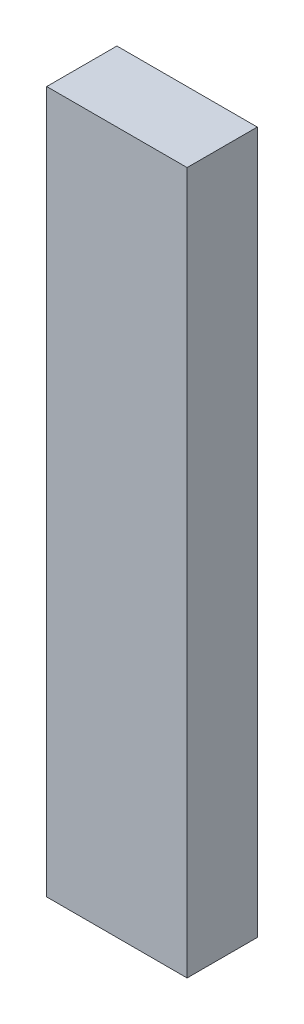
from build123d import *

# Parameters (mm, degrees)
SKETCH1_W      = 25.4
SKETCH1_H      = 127
EXTRUDE1_DEPTH = 12.7


with BuildPart() as part:
    # Sketch1 → Extrude1 (new body)
    with BuildSketch(Plane.XY):
        with Locations((12.7, 63.5)):
            Rectangle(SKETCH1_W, SKETCH1_H)
    extrude(amount=EXTRUDE1_DEPTH)


solid = part.part
